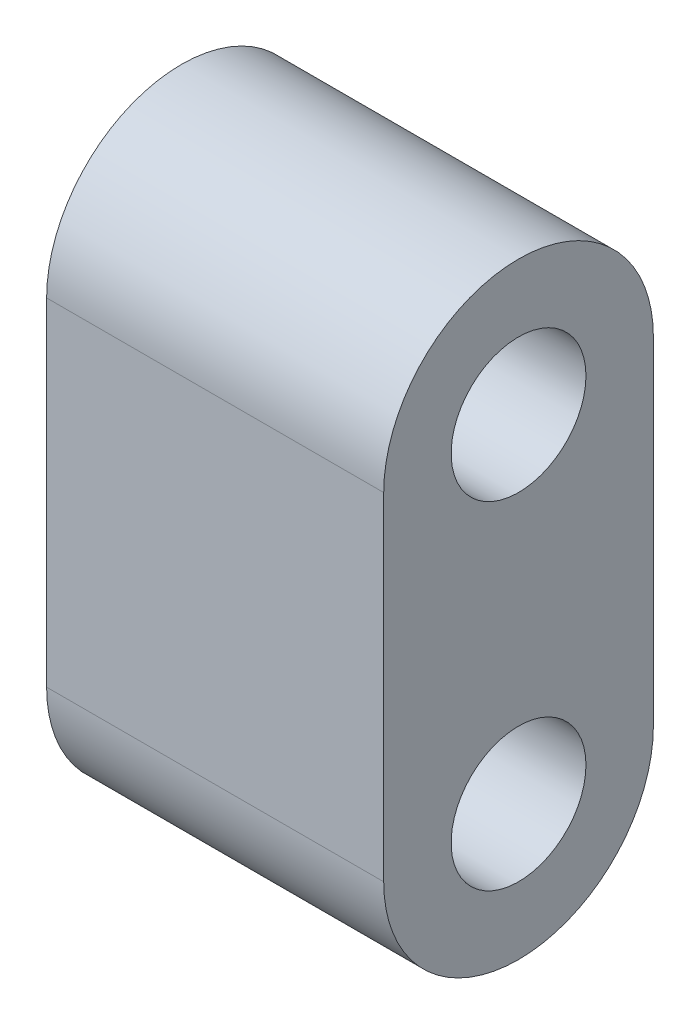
from build123d import *

# Parameters (mm, degrees)
SKETCH1_R           = 2
BOSS_EXTRUDE1_DEPTH = 5


with BuildPart() as part:
    # Sketch1 → Boss-Extrude1 (new, symmetric)
    with BuildSketch(Plane(origin=(0, 0, 0), x_dir=(0, 0, -1), z_dir=(1, 0, 0))):
        with BuildLine():
            Line((4, 10), (4, 0))
            ThreePointArc((4, 0), (0, -4), (-4, 0))
            Line((-4, 0), (-4, 10))
            ThreePointArc((-4, 10), (0, 14), (4, 10))
        make_face()
        Circle(SKETCH1_R, mode=Mode.SUBTRACT)
        with Locations((0, 10)):
            Circle(SKETCH1_R, mode=Mode.SUBTRACT)
    extrude(amount=BOSS_EXTRUDE1_DEPTH, both=True)


solid = part.part
